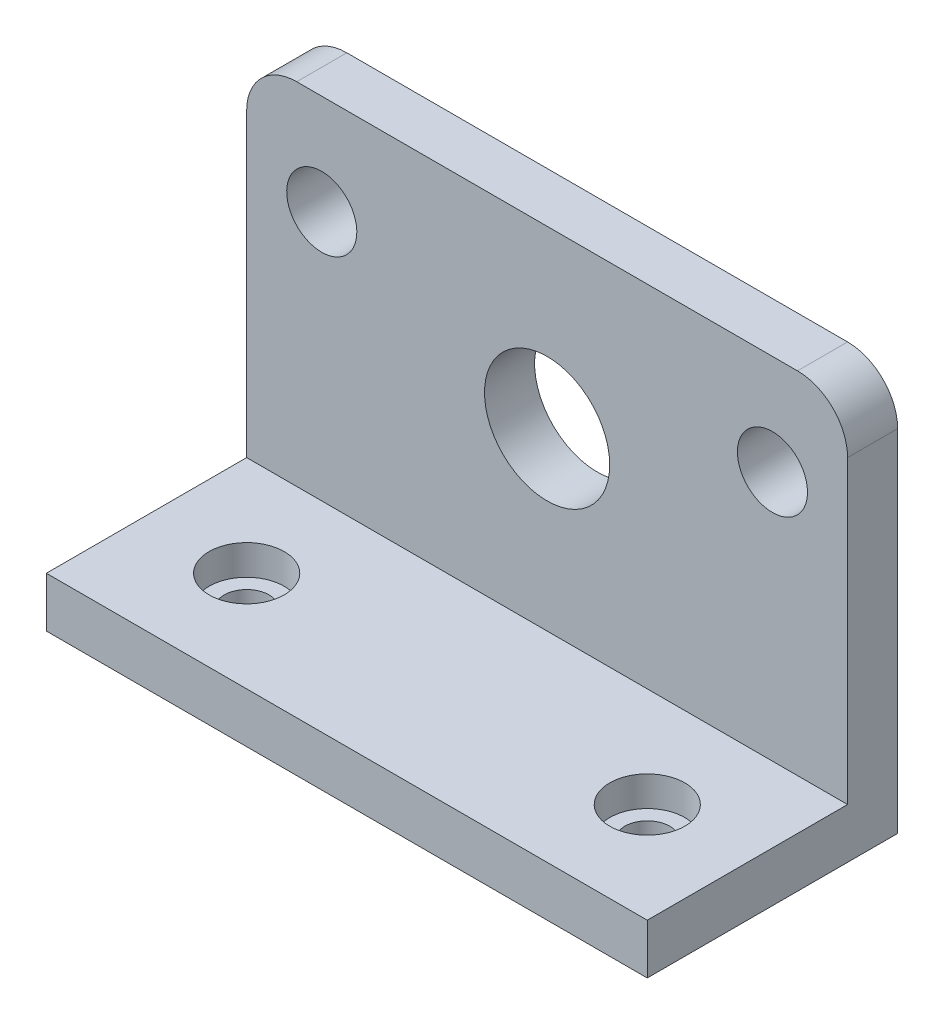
from build123d import *

# Parameters (mm, degrees)
AUFSATZ_LINEAR_AUSTRAGEN1_DEPTH                      = 60
SKIZZE2_R                                            = 12.5
SCHNITT_LINEAR_AUSTRAGEN1_DEPTH                      = 108.703296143
M16_GEWINDEBOHRUNG1_D                                = 14
STIRNSENKUNG_F_R_M8_ZYLINDERSCHRAUBE_MIT_D           = 9
STIRNSENKUNG_F_R_M8_ZYLINDERSCHRAUBE_MIT_CBORE_D     = 15
STIRNSENKUNG_F_R_M8_ZYLINDERSCHRAUBE_MIT_CBORE_DEPTH = 6
VERRUNDUNG1_R                                        = 10


with BuildPart() as part:
    # Skizze1 → Aufsatz-Linear austragen1 (new, symmetric)
    with BuildSketch(Plane(origin=(0, 0, 0), x_dir=(0, 0, -1), z_dir=(1, 0, 0))):
        Polygon((0, 0), (50, 0), (50, 80), (40, 80), (40, 10), (0, 10), align=None)
    extrude(amount=AUFSATZ_LINEAR_AUSTRAGEN1_DEPTH, both=True)

    # Skizze2 → Schnitt-Linear austragen1 (cut, through all)
    with BuildSketch(Plane.XY.offset(-40)):
        with Locations((0, 45)):
            Circle(SKIZZE2_R)
    extrude(amount=-SCHNITT_LINEAR_AUSTRAGEN1_DEPTH, mode=Mode.SUBTRACT)

    # M16 Gewindebohrung1 (through all)
    with Locations(Plane(origin=(-45, 60, -40), x_dir=(0, 1, 0), z_dir=(0, 0, 1))):
        with Locations((0, 0), (0, -90)):
            Hole(M16_GEWINDEBOHRUNG1_D / 2)

    # Stirnsenkung f_r M8 Zylinderschraube mit (through all)
    with Locations(Plane(origin=(-40, 10, -20), x_dir=(0, 0, 1), z_dir=(0, 1, 0))):
        with Locations((0, 0), (0, 80)):
            CounterBoreHole(STIRNSENKUNG_F_R_M8_ZYLINDERSCHRAUBE_MIT_D / 2, STIRNSENKUNG_F_R_M8_ZYLINDERSCHRAUBE_MIT_CBORE_D / 2, STIRNSENKUNG_F_R_M8_ZYLINDERSCHRAUBE_MIT_CBORE_DEPTH)

    # Verrundung1
    verrundung1_edges = [part.edges().sort_by_distance(p)[0] for p in [
        (60, 80, -45),
        (-60, 80, -45),
    ]]
    fillet(verrundung1_edges, radius=VERRUNDUNG1_R)


solid = part.part
